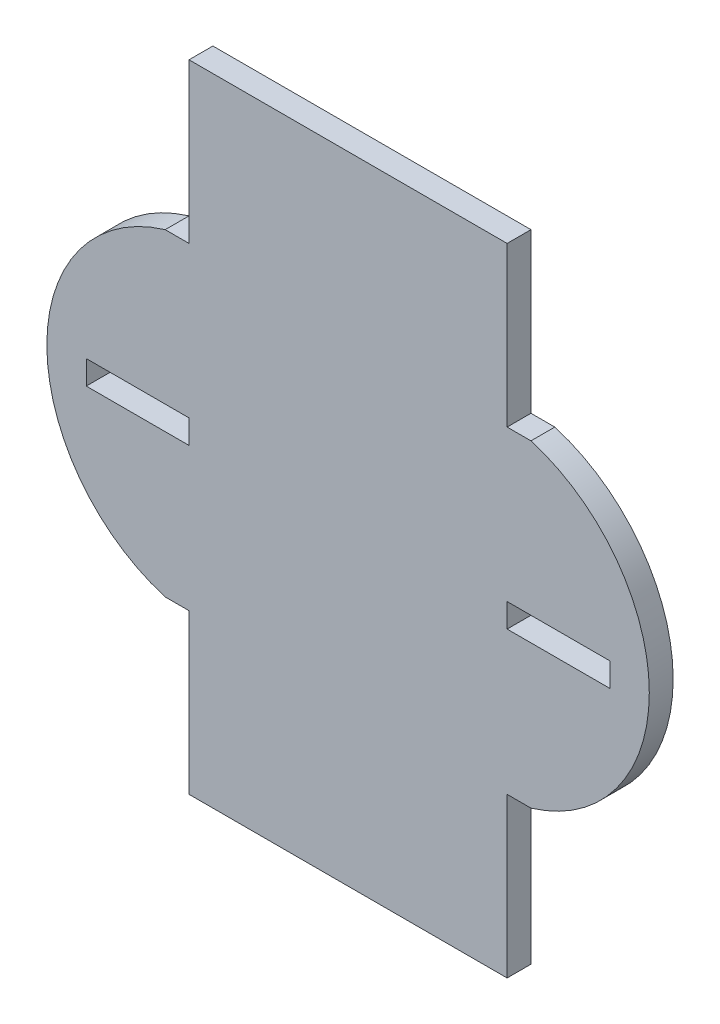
ISO-10303-21;
HEADER;
FILE_DESCRIPTION(('STEP AP214'),'2;1');
FILE_NAME('part.step','',(''),(''),'','','');
FILE_SCHEMA(('AUTOMOTIVE_DESIGN { 1 0 10303 214 1 1 1 1 }'));
ENDSEC;
DATA;
#1=APPLICATION_CONTEXT('core data for automotive mechanical design processes');
#2=APPLICATION_PROTOCOL_DEFINITION('international standard','automotive_design',2000,#1);
#3=PRODUCT_CONTEXT('',#1,'mechanical');
#4=PRODUCT('Part','Part','',(#3));
#5=PRODUCT_RELATED_PRODUCT_CATEGORY('part','',(#4));
#6=PRODUCT_DEFINITION_FORMATION('','',#4);
#7=PRODUCT_DEFINITION_CONTEXT('part definition',#1,'design');
#8=PRODUCT_DEFINITION('design','',#6,#7);
#9=PRODUCT_DEFINITION_SHAPE('','',#8);
#10=(LENGTH_UNIT() NAMED_UNIT(*) SI_UNIT(.MILLI.,.METRE.));
#11=(NAMED_UNIT(*) PLANE_ANGLE_UNIT() SI_UNIT($,.RADIAN.));
#12=(NAMED_UNIT(*) SI_UNIT($,.STERADIAN.) SOLID_ANGLE_UNIT());
#13=UNCERTAINTY_MEASURE_WITH_UNIT(LENGTH_MEASURE(1.E-05),#10,'distance_accuracy_value','');
#14=(GEOMETRIC_REPRESENTATION_CONTEXT(3) GLOBAL_UNCERTAINTY_ASSIGNED_CONTEXT((#13)) GLOBAL_UNIT_ASSIGNED_CONTEXT((#10,
#11,#12)) REPRESENTATION_CONTEXT('',''));
#15=CARTESIAN_POINT('',(0.,0.,0.));
#16=DIRECTION('',(0.,0.,1.));
#17=DIRECTION('',(1.,0.,0.));
#18=AXIS2_PLACEMENT_3D('',#15,#16,#17);
#19=CARTESIAN_POINT('',(-18.3157645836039,26.8156424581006,3.));
#20=DIRECTION('',(0.,0.,1.));
#21=DIRECTION('',(1.,0.,0.));
#22=AXIS2_PLACEMENT_3D('',#19,#20,#21);
#23=PLANE('',#22);
#24=DIRECTION('',(0.,-1.,0.));
#25=VECTOR('',#24,1.);
#26=CARTESIAN_POINT('',(-21.315764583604,66.8156424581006,3.));
#27=LINE('',#26,#25);
#28=CARTESIAN_POINT('',(-21.315764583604,66.8156424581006,3.));
#29=VERTEX_POINT('',#28);
#30=CARTESIAN_POINT('',(-21.315764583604,46.8156424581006,3.));
#31=VERTEX_POINT('',#30);
#32=EDGE_CURVE('E237',#29,#31,#27,.T.);
#33=ORIENTED_EDGE('',*,*,#32,.T.);
#34=DIRECTION('',(-1.,0.,0.));
#35=VECTOR('',#34,1.);
#36=CARTESIAN_POINT('',(-21.315764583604,46.8156424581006,3.));
#37=LINE('',#36,#35);
#38=CARTESIAN_POINT('',(-24.315764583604,46.8156424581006,3.));
#39=VERTEX_POINT('',#38);
#40=EDGE_CURVE('E240',#31,#39,#37,.T.);
#41=ORIENTED_EDGE('',*,*,#40,.T.);
#42=CARTESIAN_POINT('',(-18.3157645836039,26.8156424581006,3.));
#43=DIRECTION('',(0.,0.,1.));
#44=DIRECTION('',(1.,0.,0.));
#45=AXIS2_PLACEMENT_3D('',#42,#43,#44);
#46=CIRCLE('',#45,20.8806130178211);
#47=CARTESIAN_POINT('',(-24.315764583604,6.81564245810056,3.));
#48=VERTEX_POINT('',#47);
#49=EDGE_CURVE('E243',#39,#48,#46,.T.);
#50=ORIENTED_EDGE('',*,*,#49,.T.);
#51=DIRECTION('',(1.,0.,0.));
#52=VECTOR('',#51,1.);
#53=CARTESIAN_POINT('',(-24.315764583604,6.81564245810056,3.));
#54=LINE('',#53,#52);
#55=CARTESIAN_POINT('',(-21.315764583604,6.81564245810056,3.));
#56=VERTEX_POINT('',#55);
#57=EDGE_CURVE('E245',#48,#56,#54,.T.);
#58=ORIENTED_EDGE('',*,*,#57,.T.);
#59=DIRECTION('',(0.,-1.,0.));
#60=VECTOR('',#59,1.);
#61=CARTESIAN_POINT('',(-21.315764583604,6.81564245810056,3.));
#62=LINE('',#61,#60);
#63=CARTESIAN_POINT('',(-21.315764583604,-13.1843575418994,3.));
#64=VERTEX_POINT('',#63);
#65=EDGE_CURVE('E247',#56,#64,#62,.T.);
#66=ORIENTED_EDGE('',*,*,#65,.T.);
#67=DIRECTION('',(1.,0.,0.));
#68=VECTOR('',#67,1.);
#69=CARTESIAN_POINT('',(-21.315764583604,-13.1843575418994,3.));
#70=LINE('',#69,#68);
#71=CARTESIAN_POINT('',(18.684235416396,-13.1843575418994,3.));
#72=VERTEX_POINT('',#71);
#73=EDGE_CURVE('E249',#64,#72,#70,.T.);
#74=ORIENTED_EDGE('',*,*,#73,.T.);
#75=DIRECTION('',(0.,1.,0.));
#76=VECTOR('',#75,1.);
#77=CARTESIAN_POINT('',(18.684235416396,6.81564245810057,3.));
#78=LINE('',#77,#76);
#79=CARTESIAN_POINT('',(18.684235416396,6.81564245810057,3.));
#80=VERTEX_POINT('',#79);
#81=EDGE_CURVE('E251',#72,#80,#78,.T.);
#82=ORIENTED_EDGE('',*,*,#81,.T.);
#83=DIRECTION('',(1.,0.,0.));
#84=VECTOR('',#83,1.);
#85=CARTESIAN_POINT('',(21.684235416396,6.81564245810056,3.));
#86=LINE('',#85,#84);
#87=CARTESIAN_POINT('',(21.684235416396,6.81564245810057,3.));
#88=VERTEX_POINT('',#87);
#89=EDGE_CURVE('E253',#80,#88,#86,.T.);
#90=ORIENTED_EDGE('',*,*,#89,.T.);
#91=CARTESIAN_POINT('',(15.684235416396,26.8156424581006,3.));
#92=DIRECTION('',(0.,0.,1.));
#93=DIRECTION('',(-1.,0.,0.));
#94=AXIS2_PLACEMENT_3D('',#91,#92,#93);
#95=CIRCLE('',#94,20.8806130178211);
#96=CARTESIAN_POINT('',(21.684235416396,46.8156424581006,3.));
#97=VERTEX_POINT('',#96);
#98=EDGE_CURVE('E255',#88,#97,#95,.T.);
#99=ORIENTED_EDGE('',*,*,#98,.T.);
#100=DIRECTION('',(-1.,0.,0.));
#101=VECTOR('',#100,1.);
#102=CARTESIAN_POINT('',(18.684235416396,46.8156424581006,3.));
#103=LINE('',#102,#101);
#104=CARTESIAN_POINT('',(18.684235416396,46.8156424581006,3.));
#105=VERTEX_POINT('',#104);
#106=EDGE_CURVE('E257',#97,#105,#103,.T.);
#107=ORIENTED_EDGE('',*,*,#106,.T.);
#108=DIRECTION('',(0.,1.,0.));
#109=VECTOR('',#108,1.);
#110=CARTESIAN_POINT('',(18.684235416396,66.8156424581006,3.));
#111=LINE('',#110,#109);
#112=CARTESIAN_POINT('',(18.684235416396,66.8156424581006,3.));
#113=VERTEX_POINT('',#112);
#114=EDGE_CURVE('E259',#105,#113,#111,.T.);
#115=ORIENTED_EDGE('',*,*,#114,.T.);
#116=DIRECTION('',(-1.,0.,0.));
#117=VECTOR('',#116,1.);
#118=CARTESIAN_POINT('',(-21.315764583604,66.8156424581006,3.));
#119=LINE('',#118,#117);
#120=EDGE_CURVE('E261',#113,#29,#119,.T.);
#121=ORIENTED_EDGE('',*,*,#120,.T.);
#122=EDGE_LOOP('',(#33,#41,#50,#58,#66,#74,#82,#90,#99,#107,#115,#121));
#123=FACE_BOUND('',#122,.T.);
#124=DIRECTION('',(1.,0.,0.));
#125=VECTOR('',#124,1.);
#126=CARTESIAN_POINT('',(18.6842354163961,24.8156424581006,3.));
#127=LINE('',#126,#125);
#128=CARTESIAN_POINT('',(18.6842354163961,24.8156424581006,3.));
#129=VERTEX_POINT('',#128);
#130=CARTESIAN_POINT('',(31.6081280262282,24.8156424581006,3.));
#131=VERTEX_POINT('',#130);
#132=EDGE_CURVE('E208',#129,#131,#127,.T.);
#133=ORIENTED_EDGE('',*,*,#132,.F.);
#134=DIRECTION('',(0.,-1.,0.));
#135=VECTOR('',#134,1.);
#136=CARTESIAN_POINT('',(18.6842354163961,24.8156424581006,3.));
#137=LINE('',#136,#135);
#138=CARTESIAN_POINT('',(18.6842354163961,27.8156424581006,3.));
#139=VERTEX_POINT('',#138);
#140=EDGE_CURVE('E206',#139,#129,#137,.T.);
#141=ORIENTED_EDGE('',*,*,#140,.F.);
#142=DIRECTION('',(-1.,0.,0.));
#143=VECTOR('',#142,1.);
#144=CARTESIAN_POINT('',(18.6842354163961,27.8156424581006,3.));
#145=LINE('',#144,#143);
#146=CARTESIAN_POINT('',(31.6081280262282,27.8156424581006,3.));
#147=VERTEX_POINT('',#146);
#148=EDGE_CURVE('E214',#147,#139,#145,.T.);
#149=ORIENTED_EDGE('',*,*,#148,.F.);
#150=DIRECTION('',(0.,1.,0.));
#151=VECTOR('',#150,1.);
#152=CARTESIAN_POINT('',(31.6081280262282,24.8156424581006,3.));
#153=LINE('',#152,#151);
#154=EDGE_CURVE('E211',#131,#147,#153,.T.);
#155=ORIENTED_EDGE('',*,*,#154,.F.);
#156=EDGE_LOOP('',(#133,#141,#149,#155));
#157=FACE_BOUND('',#156,.T.);
#158=DIRECTION('',(0.,1.,0.));
#159=VECTOR('',#158,1.);
#160=CARTESIAN_POINT('',(-21.315764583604,24.8156424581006,3.));
#161=LINE('',#160,#159);
#162=CARTESIAN_POINT('',(-21.315764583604,24.8156424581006,3.));
#163=VERTEX_POINT('',#162);
#164=CARTESIAN_POINT('',(-21.315764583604,27.8156424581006,3.));
#165=VERTEX_POINT('',#164);
#166=EDGE_CURVE('E178',#163,#165,#161,.T.);
#167=ORIENTED_EDGE('',*,*,#166,.F.);
#168=DIRECTION('',(1.,0.,0.));
#169=VECTOR('',#168,1.);
#170=CARTESIAN_POINT('',(-21.315764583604,24.8156424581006,3.));
#171=LINE('',#170,#169);
#172=CARTESIAN_POINT('',(-34.2396571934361,24.8156424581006,3.));
#173=VERTEX_POINT('',#172);
#174=EDGE_CURVE('E170',#173,#163,#171,.T.);
#175=ORIENTED_EDGE('',*,*,#174,.F.);
#176=DIRECTION('',(0.,-1.,0.));
#177=VECTOR('',#176,1.);
#178=CARTESIAN_POINT('',(-34.2396571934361,24.8156424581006,3.));
#179=LINE('',#178,#177);
#180=CARTESIAN_POINT('',(-34.2396571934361,27.8156424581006,3.));
#181=VERTEX_POINT('',#180);
#182=EDGE_CURVE('E192',#181,#173,#179,.T.);
#183=ORIENTED_EDGE('',*,*,#182,.F.);
#184=DIRECTION('',(-1.,0.,0.));
#185=VECTOR('',#184,1.);
#186=CARTESIAN_POINT('',(-21.315764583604,27.8156424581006,3.));
#187=LINE('',#186,#185);
#188=EDGE_CURVE('E190',#165,#181,#187,.T.);
#189=ORIENTED_EDGE('',*,*,#188,.F.);
#190=EDGE_LOOP('',(#167,#175,#183,#189));
#191=FACE_BOUND('',#190,.T.);
#192=ADVANCED_FACE('F33',(#123,#157,#191),#23,.T.);
#193=CARTESIAN_POINT('',(-18.3157645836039,26.8156424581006,0.));
#194=DIRECTION('',(0.,0.,1.));
#195=DIRECTION('',(1.,0.,0.));
#196=AXIS2_PLACEMENT_3D('',#193,#194,#195);
#197=PLANE('',#196);
#198=DIRECTION('',(0.,-1.,0.));
#199=VECTOR('',#198,1.);
#200=CARTESIAN_POINT('',(18.6842354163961,24.8156424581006,0.));
#201=LINE('',#200,#199);
#202=CARTESIAN_POINT('',(18.6842354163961,27.8156424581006,0.));
#203=VERTEX_POINT('',#202);
#204=CARTESIAN_POINT('',(18.6842354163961,24.8156424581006,0.));
#205=VERTEX_POINT('',#204);
#206=EDGE_CURVE('E186',#203,#205,#201,.T.);
#207=ORIENTED_EDGE('',*,*,#206,.T.);
#208=DIRECTION('',(1.,0.,0.));
#209=VECTOR('',#208,1.);
#210=CARTESIAN_POINT('',(18.6842354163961,24.8156424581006,0.));
#211=LINE('',#210,#209);
#212=CARTESIAN_POINT('',(31.6081280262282,24.8156424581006,0.));
#213=VERTEX_POINT('',#212);
#214=EDGE_CURVE('E219',#205,#213,#211,.T.);
#215=ORIENTED_EDGE('',*,*,#214,.T.);
#216=DIRECTION('',(0.,1.,0.));
#217=VECTOR('',#216,1.);
#218=CARTESIAN_POINT('',(31.6081280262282,24.8156424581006,0.));
#219=LINE('',#218,#217);
#220=CARTESIAN_POINT('',(31.6081280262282,27.8156424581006,0.));
#221=VERTEX_POINT('',#220);
#222=EDGE_CURVE('E222',#213,#221,#219,.T.);
#223=ORIENTED_EDGE('',*,*,#222,.T.);
#224=DIRECTION('',(-1.,0.,0.));
#225=VECTOR('',#224,1.);
#226=CARTESIAN_POINT('',(18.6842354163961,27.8156424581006,0.));
#227=LINE('',#226,#225);
#228=EDGE_CURVE('E209',#221,#203,#227,.T.);
#229=ORIENTED_EDGE('',*,*,#228,.T.);
#230=EDGE_LOOP('',(#207,#215,#223,#229));
#231=FACE_BOUND('',#230,.T.);
#232=DIRECTION('',(0.,-1.,0.));
#233=VECTOR('',#232,1.);
#234=CARTESIAN_POINT('',(-21.315764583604,66.8156424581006,0.));
#235=LINE('',#234,#233);
#236=CARTESIAN_POINT('',(-21.315764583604,66.8156424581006,0.));
#237=VERTEX_POINT('',#236);
#238=CARTESIAN_POINT('',(-21.315764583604,46.8156424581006,0.));
#239=VERTEX_POINT('',#238);
#240=EDGE_CURVE('E236',#237,#239,#235,.T.);
#241=ORIENTED_EDGE('',*,*,#240,.F.);
#242=DIRECTION('',(-1.,0.,0.));
#243=VECTOR('',#242,1.);
#244=CARTESIAN_POINT('',(-21.315764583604,66.8156424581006,0.));
#245=LINE('',#244,#243);
#246=CARTESIAN_POINT('',(18.684235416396,66.8156424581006,0.));
#247=VERTEX_POINT('',#246);
#248=EDGE_CURVE('E241',#247,#237,#245,.T.);
#249=ORIENTED_EDGE('',*,*,#248,.F.);
#250=DIRECTION('',(0.,1.,0.));
#251=VECTOR('',#250,1.);
#252=CARTESIAN_POINT('',(18.684235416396,66.8156424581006,0.));
#253=LINE('',#252,#251);
#254=CARTESIAN_POINT('',(18.684235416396,46.8156424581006,0.));
#255=VERTEX_POINT('',#254);
#256=EDGE_CURVE('E284',#255,#247,#253,.T.);
#257=ORIENTED_EDGE('',*,*,#256,.F.);
#258=DIRECTION('',(-1.,0.,0.));
#259=VECTOR('',#258,1.);
#260=CARTESIAN_POINT('',(18.684235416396,46.8156424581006,0.));
#261=LINE('',#260,#259);
#262=CARTESIAN_POINT('',(21.684235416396,46.8156424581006,0.));
#263=VERTEX_POINT('',#262);
#264=EDGE_CURVE('E282',#263,#255,#261,.T.);
#265=ORIENTED_EDGE('',*,*,#264,.F.);
#266=CARTESIAN_POINT('',(15.684235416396,26.8156424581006,0.));
#267=DIRECTION('',(0.,0.,1.));
#268=DIRECTION('',(-1.,0.,0.));
#269=AXIS2_PLACEMENT_3D('',#266,#267,#268);
#270=CIRCLE('',#269,20.8806130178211);
#271=CARTESIAN_POINT('',(21.684235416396,6.81564245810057,0.));
#272=VERTEX_POINT('',#271);
#273=EDGE_CURVE('E280',#272,#263,#270,.T.);
#274=ORIENTED_EDGE('',*,*,#273,.F.);
#275=DIRECTION('',(1.,0.,0.));
#276=VECTOR('',#275,1.);
#277=CARTESIAN_POINT('',(21.684235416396,6.81564245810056,0.));
#278=LINE('',#277,#276);
#279=CARTESIAN_POINT('',(18.684235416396,6.81564245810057,0.));
#280=VERTEX_POINT('',#279);
#281=EDGE_CURVE('E278',#280,#272,#278,.T.);
#282=ORIENTED_EDGE('',*,*,#281,.F.);
#283=DIRECTION('',(0.,1.,0.));
#284=VECTOR('',#283,1.);
#285=CARTESIAN_POINT('',(18.684235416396,6.81564245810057,0.));
#286=LINE('',#285,#284);
#287=CARTESIAN_POINT('',(18.684235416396,-13.1843575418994,0.));
#288=VERTEX_POINT('',#287);
#289=EDGE_CURVE('E276',#288,#280,#286,.T.);
#290=ORIENTED_EDGE('',*,*,#289,.F.);
#291=DIRECTION('',(1.,0.,0.));
#292=VECTOR('',#291,1.);
#293=CARTESIAN_POINT('',(-21.315764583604,-13.1843575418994,0.));
#294=LINE('',#293,#292);
#295=CARTESIAN_POINT('',(-21.315764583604,-13.1843575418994,0.));
#296=VERTEX_POINT('',#295);
#297=EDGE_CURVE('E274',#296,#288,#294,.T.);
#298=ORIENTED_EDGE('',*,*,#297,.F.);
#299=DIRECTION('',(0.,-1.,0.));
#300=VECTOR('',#299,1.);
#301=CARTESIAN_POINT('',(-21.315764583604,6.81564245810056,0.));
#302=LINE('',#301,#300);
#303=CARTESIAN_POINT('',(-21.315764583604,6.81564245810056,0.));
#304=VERTEX_POINT('',#303);
#305=EDGE_CURVE('E272',#304,#296,#302,.T.);
#306=ORIENTED_EDGE('',*,*,#305,.F.);
#307=DIRECTION('',(1.,0.,0.));
#308=VECTOR('',#307,1.);
#309=CARTESIAN_POINT('',(-24.315764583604,6.81564245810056,0.));
#310=LINE('',#309,#308);
#311=CARTESIAN_POINT('',(-24.315764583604,6.81564245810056,0.));
#312=VERTEX_POINT('',#311);
#313=EDGE_CURVE('E270',#312,#304,#310,.T.);
#314=ORIENTED_EDGE('',*,*,#313,.F.);
#315=CARTESIAN_POINT('',(-18.3157645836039,26.8156424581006,0.));
#316=DIRECTION('',(0.,0.,1.));
#317=DIRECTION('',(1.,0.,0.));
#318=AXIS2_PLACEMENT_3D('',#315,#316,#317);
#319=CIRCLE('',#318,20.8806130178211);
#320=CARTESIAN_POINT('',(-24.315764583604,46.8156424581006,0.));
#321=VERTEX_POINT('',#320);
#322=EDGE_CURVE('E268',#321,#312,#319,.T.);
#323=ORIENTED_EDGE('',*,*,#322,.F.);
#324=DIRECTION('',(-1.,0.,0.));
#325=VECTOR('',#324,1.);
#326=CARTESIAN_POINT('',(-21.315764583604,46.8156424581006,0.));
#327=LINE('',#326,#325);
#328=EDGE_CURVE('E266',#239,#321,#327,.T.);
#329=ORIENTED_EDGE('',*,*,#328,.F.);
#330=EDGE_LOOP('',(#241,#249,#257,#265,#274,#282,#290,#298,#306,#314,#323,#329));
#331=FACE_BOUND('',#330,.T.);
#332=DIRECTION('',(1.,0.,0.));
#333=VECTOR('',#332,1.);
#334=CARTESIAN_POINT('',(-21.315764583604,24.8156424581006,0.));
#335=LINE('',#334,#333);
#336=CARTESIAN_POINT('',(-34.2396571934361,24.8156424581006,0.));
#337=VERTEX_POINT('',#336);
#338=CARTESIAN_POINT('',(-21.315764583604,24.8156424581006,0.));
#339=VERTEX_POINT('',#338);
#340=EDGE_CURVE('E56',#337,#339,#335,.T.);
#341=ORIENTED_EDGE('',*,*,#340,.T.);
#342=DIRECTION('',(0.,1.,0.));
#343=VECTOR('',#342,1.);
#344=CARTESIAN_POINT('',(-21.315764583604,24.8156424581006,0.));
#345=LINE('',#344,#343);
#346=CARTESIAN_POINT('',(-21.315764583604,27.8156424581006,0.));
#347=VERTEX_POINT('',#346);
#348=EDGE_CURVE('E185',#339,#347,#345,.T.);
#349=ORIENTED_EDGE('',*,*,#348,.T.);
#350=DIRECTION('',(-1.,0.,0.));
#351=VECTOR('',#350,1.);
#352=CARTESIAN_POINT('',(-21.315764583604,27.8156424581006,0.));
#353=LINE('',#352,#351);
#354=CARTESIAN_POINT('',(-34.2396571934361,27.8156424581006,0.));
#355=VERTEX_POINT('',#354);
#356=EDGE_CURVE('E198',#347,#355,#353,.T.);
#357=ORIENTED_EDGE('',*,*,#356,.T.);
#358=DIRECTION('',(0.,-1.,0.));
#359=VECTOR('',#358,1.);
#360=CARTESIAN_POINT('',(-34.2396571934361,24.8156424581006,0.));
#361=LINE('',#360,#359);
#362=EDGE_CURVE('E179',#355,#337,#361,.T.);
#363=ORIENTED_EDGE('',*,*,#362,.T.);
#364=EDGE_LOOP('',(#341,#349,#357,#363));
#365=FACE_BOUND('',#364,.T.);
#366=ADVANCED_FACE('F326',(#231,#331,#365),#197,.F.);
#367=CARTESIAN_POINT('',(-21.315764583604,66.8156424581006,3.));
#368=DIRECTION('',(1.,0.,0.));
#369=DIRECTION('',(0.,1.,0.));
#370=AXIS2_PLACEMENT_3D('',#367,#368,#369);
#371=PLANE('',#370);
#372=ORIENTED_EDGE('',*,*,#240,.T.);
#373=DIRECTION('',(0.,0.,-1.));
#374=VECTOR('',#373,1.);
#375=CARTESIAN_POINT('',(-21.315764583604,46.8156424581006,3.));
#376=LINE('',#375,#374);
#377=EDGE_CURVE('E11',#31,#239,#376,.T.);
#378=ORIENTED_EDGE('',*,*,#377,.F.);
#379=ORIENTED_EDGE('',*,*,#32,.F.);
#380=DIRECTION('',(0.,0.,-1.));
#381=VECTOR('',#380,1.);
#382=CARTESIAN_POINT('',(-21.315764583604,66.8156424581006,3.));
#383=LINE('',#382,#381);
#384=EDGE_CURVE('E263',#29,#237,#383,.T.);
#385=ORIENTED_EDGE('',*,*,#384,.T.);
#386=EDGE_LOOP('',(#372,#378,#379,#385));
#387=FACE_BOUND('',#386,.T.);
#388=ADVANCED_FACE('F35',(#387),#371,.F.);
#389=CARTESIAN_POINT('',(-21.315764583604,46.8156424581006,3.));
#390=DIRECTION('',(0.,-1.,0.));
#391=DIRECTION('',(0.,0.,-1.));
#392=AXIS2_PLACEMENT_3D('',#389,#390,#391);
#393=PLANE('',#392);
#394=ORIENTED_EDGE('',*,*,#328,.T.);
#395=DIRECTION('',(0.,0.,-1.));
#396=VECTOR('',#395,1.);
#397=CARTESIAN_POINT('',(-24.315764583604,46.8156424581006,3.));
#398=LINE('',#397,#396);
#399=EDGE_CURVE('E41',#39,#321,#398,.T.);
#400=ORIENTED_EDGE('',*,*,#399,.F.);
#401=ORIENTED_EDGE('',*,*,#40,.F.);
#402=ORIENTED_EDGE('',*,*,#377,.T.);
#403=EDGE_LOOP('',(#394,#400,#401,#402));
#404=FACE_BOUND('',#403,.T.);
#405=ADVANCED_FACE('F344',(#404),#393,.F.);
#406=CARTESIAN_POINT('',(-18.3157645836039,26.8156424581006,3.));
#407=DIRECTION('',(0.,0.,-1.));
#408=DIRECTION('',(-1.,0.,0.));
#409=AXIS2_PLACEMENT_3D('',#406,#407,#408);
#410=CYLINDRICAL_SURFACE('',#409,20.8806130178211);
#411=ORIENTED_EDGE('',*,*,#322,.T.);
#412=DIRECTION('',(0.,0.,-1.));
#413=VECTOR('',#412,1.);
#414=CARTESIAN_POINT('',(-24.315764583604,6.81564245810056,3.));
#415=LINE('',#414,#413);
#416=EDGE_CURVE('E313',#48,#312,#415,.T.);
#417=ORIENTED_EDGE('',*,*,#416,.F.);
#418=ORIENTED_EDGE('',*,*,#49,.F.);
#419=ORIENTED_EDGE('',*,*,#399,.T.);
#420=EDGE_LOOP('',(#411,#417,#418,#419));
#421=FACE_BOUND('',#420,.T.);
#422=ADVANCED_FACE('F320',(#421),#410,.T.);
#423=CARTESIAN_POINT('',(-24.315764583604,6.81564245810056,3.));
#424=DIRECTION('',(0.,1.,0.));
#425=DIRECTION('',(0.,0.,1.));
#426=AXIS2_PLACEMENT_3D('',#423,#424,#425);
#427=PLANE('',#426);
#428=ORIENTED_EDGE('',*,*,#313,.T.);
#429=DIRECTION('',(0.,0.,-1.));
#430=VECTOR('',#429,1.);
#431=CARTESIAN_POINT('',(-21.315764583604,6.81564245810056,3.));
#432=LINE('',#431,#430);
#433=EDGE_CURVE('E310',#56,#304,#432,.T.);
#434=ORIENTED_EDGE('',*,*,#433,.F.);
#435=ORIENTED_EDGE('',*,*,#57,.F.);
#436=ORIENTED_EDGE('',*,*,#416,.T.);
#437=EDGE_LOOP('',(#428,#434,#435,#436));
#438=FACE_BOUND('',#437,.T.);
#439=ADVANCED_FACE('F332',(#438),#427,.F.);
#440=CARTESIAN_POINT('',(-21.315764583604,6.81564245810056,3.));
#441=DIRECTION('',(1.,0.,0.));
#442=DIRECTION('',(0.,0.,-1.));
#443=AXIS2_PLACEMENT_3D('',#440,#441,#442);
#444=PLANE('',#443);
#445=ORIENTED_EDGE('',*,*,#305,.T.);
#446=DIRECTION('',(0.,0.,-1.));
#447=VECTOR('',#446,1.);
#448=CARTESIAN_POINT('',(-21.315764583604,-13.1843575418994,3.));
#449=LINE('',#448,#447);
#450=EDGE_CURVE('E307',#64,#296,#449,.T.);
#451=ORIENTED_EDGE('',*,*,#450,.F.);
#452=ORIENTED_EDGE('',*,*,#65,.F.);
#453=ORIENTED_EDGE('',*,*,#433,.T.);
#454=EDGE_LOOP('',(#445,#451,#452,#453));
#455=FACE_BOUND('',#454,.T.);
#456=ADVANCED_FACE('F336',(#455),#444,.F.);
#457=CARTESIAN_POINT('',(-21.315764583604,-13.1843575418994,3.));
#458=DIRECTION('',(0.,1.,0.));
#459=DIRECTION('',(0.,0.,1.));
#460=AXIS2_PLACEMENT_3D('',#457,#458,#459);
#461=PLANE('',#460);
#462=ORIENTED_EDGE('',*,*,#297,.T.);
#463=DIRECTION('',(0.,0.,-1.));
#464=VECTOR('',#463,1.);
#465=CARTESIAN_POINT('',(18.684235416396,-13.1843575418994,3.));
#466=LINE('',#465,#464);
#467=EDGE_CURVE('E304',#72,#288,#466,.T.);
#468=ORIENTED_EDGE('',*,*,#467,.F.);
#469=ORIENTED_EDGE('',*,*,#73,.F.);
#470=ORIENTED_EDGE('',*,*,#450,.T.);
#471=EDGE_LOOP('',(#462,#468,#469,#470));
#472=FACE_BOUND('',#471,.T.);
#473=ADVANCED_FACE('F377',(#472),#461,.F.);
#474=CARTESIAN_POINT('',(18.684235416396,6.81564245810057,3.));
#475=DIRECTION('',(-1.,0.,0.));
#476=DIRECTION('',(0.,-1.,0.));
#477=AXIS2_PLACEMENT_3D('',#474,#475,#476);
#478=PLANE('',#477);
#479=ORIENTED_EDGE('',*,*,#289,.T.);
#480=DIRECTION('',(0.,0.,-1.));
#481=VECTOR('',#480,1.);
#482=CARTESIAN_POINT('',(18.684235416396,6.81564245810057,3.));
#483=LINE('',#482,#481);
#484=EDGE_CURVE('E301',#80,#280,#483,.T.);
#485=ORIENTED_EDGE('',*,*,#484,.F.);
#486=ORIENTED_EDGE('',*,*,#81,.F.);
#487=ORIENTED_EDGE('',*,*,#467,.T.);
#488=EDGE_LOOP('',(#479,#485,#486,#487));
#489=FACE_BOUND('',#488,.T.);
#490=ADVANCED_FACE('F375',(#489),#478,.F.);
#491=CARTESIAN_POINT('',(21.684235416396,6.81564245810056,3.));
#492=DIRECTION('',(0.,1.,0.));
#493=DIRECTION('',(-1.,0.,0.));
#494=AXIS2_PLACEMENT_3D('',#491,#492,#493);
#495=PLANE('',#494);
#496=ORIENTED_EDGE('',*,*,#281,.T.);
#497=DIRECTION('',(0.,0.,-1.));
#498=VECTOR('',#497,1.);
#499=CARTESIAN_POINT('',(21.684235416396,6.81564245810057,3.));
#500=LINE('',#499,#498);
#501=EDGE_CURVE('E298',#88,#272,#500,.T.);
#502=ORIENTED_EDGE('',*,*,#501,.F.);
#503=ORIENTED_EDGE('',*,*,#89,.F.);
#504=ORIENTED_EDGE('',*,*,#484,.T.);
#505=EDGE_LOOP('',(#496,#502,#503,#504));
#506=FACE_BOUND('',#505,.T.);
#507=ADVANCED_FACE('F371',(#506),#495,.F.);
#508=CARTESIAN_POINT('',(15.684235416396,26.8156424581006,3.));
#509=DIRECTION('',(0.,0.,-1.));
#510=DIRECTION('',(-1.,0.,0.));
#511=AXIS2_PLACEMENT_3D('',#508,#509,#510);
#512=CYLINDRICAL_SURFACE('',#511,20.8806130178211);
#513=ORIENTED_EDGE('',*,*,#273,.T.);
#514=DIRECTION('',(0.,0.,-1.));
#515=VECTOR('',#514,1.);
#516=CARTESIAN_POINT('',(21.684235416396,46.8156424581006,3.));
#517=LINE('',#516,#515);
#518=EDGE_CURVE('E295',#97,#263,#517,.T.);
#519=ORIENTED_EDGE('',*,*,#518,.F.);
#520=ORIENTED_EDGE('',*,*,#98,.F.);
#521=ORIENTED_EDGE('',*,*,#501,.T.);
#522=EDGE_LOOP('',(#513,#519,#520,#521));
#523=FACE_BOUND('',#522,.T.);
#524=ADVANCED_FACE('F366',(#523),#512,.T.);
#525=CARTESIAN_POINT('',(18.684235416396,46.8156424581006,3.));
#526=DIRECTION('',(0.,-1.,0.));
#527=DIRECTION('',(0.,0.,-1.));
#528=AXIS2_PLACEMENT_3D('',#525,#526,#527);
#529=PLANE('',#528);
#530=ORIENTED_EDGE('',*,*,#264,.T.);
#531=DIRECTION('',(0.,0.,-1.));
#532=VECTOR('',#531,1.);
#533=CARTESIAN_POINT('',(18.684235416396,46.8156424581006,3.));
#534=LINE('',#533,#532);
#535=EDGE_CURVE('E292',#105,#255,#534,.T.);
#536=ORIENTED_EDGE('',*,*,#535,.F.);
#537=ORIENTED_EDGE('',*,*,#106,.F.);
#538=ORIENTED_EDGE('',*,*,#518,.T.);
#539=EDGE_LOOP('',(#530,#536,#537,#538));
#540=FACE_BOUND('',#539,.T.);
#541=ADVANCED_FACE('F360',(#540),#529,.F.);
#542=CARTESIAN_POINT('',(18.684235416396,66.8156424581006,3.));
#543=DIRECTION('',(-1.,0.,0.));
#544=DIRECTION('',(0.,0.,1.));
#545=AXIS2_PLACEMENT_3D('',#542,#543,#544);
#546=PLANE('',#545);
#547=ORIENTED_EDGE('',*,*,#256,.T.);
#548=DIRECTION('',(0.,0.,-1.));
#549=VECTOR('',#548,1.);
#550=CARTESIAN_POINT('',(18.684235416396,66.8156424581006,3.));
#551=LINE('',#550,#549);
#552=EDGE_CURVE('E289',#113,#247,#551,.T.);
#553=ORIENTED_EDGE('',*,*,#552,.F.);
#554=ORIENTED_EDGE('',*,*,#114,.F.);
#555=ORIENTED_EDGE('',*,*,#535,.T.);
#556=EDGE_LOOP('',(#547,#553,#554,#555));
#557=FACE_BOUND('',#556,.T.);
#558=ADVANCED_FACE('F356',(#557),#546,.F.);
#559=CARTESIAN_POINT('',(-21.315764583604,66.8156424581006,3.));
#560=DIRECTION('',(0.,-1.,0.));
#561=DIRECTION('',(0.,0.,-1.));
#562=AXIS2_PLACEMENT_3D('',#559,#560,#561);
#563=PLANE('',#562);
#564=ORIENTED_EDGE('',*,*,#248,.T.);
#565=ORIENTED_EDGE('',*,*,#384,.F.);
#566=ORIENTED_EDGE('',*,*,#120,.F.);
#567=ORIENTED_EDGE('',*,*,#552,.T.);
#568=EDGE_LOOP('',(#564,#565,#566,#567));
#569=FACE_BOUND('',#568,.T.);
#570=ADVANCED_FACE('F351',(#569),#563,.F.);
#571=CARTESIAN_POINT('',(18.6842354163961,24.8156424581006,3.));
#572=DIRECTION('',(1.,0.,0.));
#573=DIRECTION('',(0.,0.,-1.));
#574=AXIS2_PLACEMENT_3D('',#571,#572,#573);
#575=PLANE('',#574);
#576=ORIENTED_EDGE('',*,*,#206,.F.);
#577=DIRECTION('',(0.,0.,-1.));
#578=VECTOR('',#577,1.);
#579=CARTESIAN_POINT('',(18.6842354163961,27.8156424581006,3.));
#580=LINE('',#579,#578);
#581=EDGE_CURVE('E216',#139,#203,#580,.T.);
#582=ORIENTED_EDGE('',*,*,#581,.F.);
#583=ORIENTED_EDGE('',*,*,#140,.T.);
#584=DIRECTION('',(0.,0.,-1.));
#585=VECTOR('',#584,1.);
#586=CARTESIAN_POINT('',(18.6842354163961,24.8156424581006,3.));
#587=LINE('',#586,#585);
#588=EDGE_CURVE('E233',#129,#205,#587,.T.);
#589=ORIENTED_EDGE('',*,*,#588,.T.);
#590=EDGE_LOOP('',(#576,#582,#583,#589));
#591=FACE_BOUND('',#590,.T.);
#592=ADVANCED_FACE('F394',(#591),#575,.T.);
#593=CARTESIAN_POINT('',(18.6842354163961,24.8156424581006,3.));
#594=DIRECTION('',(0.,1.,0.));
#595=DIRECTION('',(0.,0.,1.));
#596=AXIS2_PLACEMENT_3D('',#593,#594,#595);
#597=PLANE('',#596);
#598=ORIENTED_EDGE('',*,*,#214,.F.);
#599=ORIENTED_EDGE('',*,*,#588,.F.);
#600=ORIENTED_EDGE('',*,*,#132,.T.);
#601=DIRECTION('',(0.,0.,-1.));
#602=VECTOR('',#601,1.);
#603=CARTESIAN_POINT('',(31.6081280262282,24.8156424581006,3.));
#604=LINE('',#603,#602);
#605=EDGE_CURVE('E231',#131,#213,#604,.T.);
#606=ORIENTED_EDGE('',*,*,#605,.T.);
#607=EDGE_LOOP('',(#598,#599,#600,#606));
#608=FACE_BOUND('',#607,.T.);
#609=ADVANCED_FACE('F432',(#608),#597,.T.);
#610=CARTESIAN_POINT('',(31.6081280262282,24.8156424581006,3.));
#611=DIRECTION('',(-1.,0.,0.));
#612=DIRECTION('',(0.,0.,1.));
#613=AXIS2_PLACEMENT_3D('',#610,#611,#612);
#614=PLANE('',#613);
#615=ORIENTED_EDGE('',*,*,#222,.F.);
#616=ORIENTED_EDGE('',*,*,#605,.F.);
#617=ORIENTED_EDGE('',*,*,#154,.T.);
#618=DIRECTION('',(0.,0.,-1.));
#619=VECTOR('',#618,1.);
#620=CARTESIAN_POINT('',(31.6081280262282,27.8156424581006,3.));
#621=LINE('',#620,#619);
#622=EDGE_CURVE('E229',#147,#221,#621,.T.);
#623=ORIENTED_EDGE('',*,*,#622,.T.);
#624=EDGE_LOOP('',(#615,#616,#617,#623));
#625=FACE_BOUND('',#624,.T.);
#626=ADVANCED_FACE('F439',(#625),#614,.T.);
#627=CARTESIAN_POINT('',(18.6842354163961,27.8156424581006,3.));
#628=DIRECTION('',(0.,-1.,0.));
#629=DIRECTION('',(0.,0.,-1.));
#630=AXIS2_PLACEMENT_3D('',#627,#628,#629);
#631=PLANE('',#630);
#632=ORIENTED_EDGE('',*,*,#228,.F.);
#633=ORIENTED_EDGE('',*,*,#622,.F.);
#634=ORIENTED_EDGE('',*,*,#148,.T.);
#635=ORIENTED_EDGE('',*,*,#581,.T.);
#636=EDGE_LOOP('',(#632,#633,#634,#635));
#637=FACE_BOUND('',#636,.T.);
#638=ADVANCED_FACE('F446',(#637),#631,.T.);
#639=CARTESIAN_POINT('',(-21.315764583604,24.8156424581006,3.));
#640=DIRECTION('',(0.,1.,0.));
#641=DIRECTION('',(0.,0.,1.));
#642=AXIS2_PLACEMENT_3D('',#639,#640,#641);
#643=PLANE('',#642);
#644=ORIENTED_EDGE('',*,*,#340,.F.);
#645=DIRECTION('',(0.,0.,-1.));
#646=VECTOR('',#645,1.);
#647=CARTESIAN_POINT('',(-34.2396571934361,24.8156424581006,3.));
#648=LINE('',#647,#646);
#649=EDGE_CURVE('E174',#173,#337,#648,.T.);
#650=ORIENTED_EDGE('',*,*,#649,.F.);
#651=ORIENTED_EDGE('',*,*,#174,.T.);
#652=DIRECTION('',(0.,0.,-1.));
#653=VECTOR('',#652,1.);
#654=CARTESIAN_POINT('',(-21.315764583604,24.8156424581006,3.));
#655=LINE('',#654,#653);
#656=EDGE_CURVE('E173',#163,#339,#655,.T.);
#657=ORIENTED_EDGE('',*,*,#656,.T.);
#658=EDGE_LOOP('',(#644,#650,#651,#657));
#659=FACE_BOUND('',#658,.T.);
#660=ADVANCED_FACE('F172',(#659),#643,.T.);
#661=CARTESIAN_POINT('',(-21.315764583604,24.8156424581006,3.));
#662=DIRECTION('',(-1.,0.,0.));
#663=DIRECTION('',(0.,0.,1.));
#664=AXIS2_PLACEMENT_3D('',#661,#662,#663);
#665=PLANE('',#664);
#666=ORIENTED_EDGE('',*,*,#348,.F.);
#667=ORIENTED_EDGE('',*,*,#656,.F.);
#668=ORIENTED_EDGE('',*,*,#166,.T.);
#669=DIRECTION('',(0.,0.,-1.));
#670=VECTOR('',#669,1.);
#671=CARTESIAN_POINT('',(-21.315764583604,27.8156424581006,3.));
#672=LINE('',#671,#670);
#673=EDGE_CURVE('E187',#165,#347,#672,.T.);
#674=ORIENTED_EDGE('',*,*,#673,.T.);
#675=EDGE_LOOP('',(#666,#667,#668,#674));
#676=FACE_BOUND('',#675,.T.);
#677=ADVANCED_FACE('F182',(#676),#665,.T.);
#678=CARTESIAN_POINT('',(-21.315764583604,27.8156424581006,3.));
#679=DIRECTION('',(0.,-1.,0.));
#680=DIRECTION('',(0.,0.,-1.));
#681=AXIS2_PLACEMENT_3D('',#678,#679,#680);
#682=PLANE('',#681);
#683=ORIENTED_EDGE('',*,*,#356,.F.);
#684=ORIENTED_EDGE('',*,*,#673,.F.);
#685=ORIENTED_EDGE('',*,*,#188,.T.);
#686=DIRECTION('',(0.,0.,-1.));
#687=VECTOR('',#686,1.);
#688=CARTESIAN_POINT('',(-34.2396571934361,27.8156424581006,3.));
#689=LINE('',#688,#687);
#690=EDGE_CURVE('E48',#181,#355,#689,.T.);
#691=ORIENTED_EDGE('',*,*,#690,.T.);
#692=EDGE_LOOP('',(#683,#684,#685,#691));
#693=FACE_BOUND('',#692,.T.);
#694=ADVANCED_FACE('F467',(#693),#682,.T.);
#695=CARTESIAN_POINT('',(-34.2396571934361,24.8156424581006,3.));
#696=DIRECTION('',(1.,0.,0.));
#697=DIRECTION('',(0.,0.,-1.));
#698=AXIS2_PLACEMENT_3D('',#695,#696,#697);
#699=PLANE('',#698);
#700=ORIENTED_EDGE('',*,*,#362,.F.);
#701=ORIENTED_EDGE('',*,*,#690,.F.);
#702=ORIENTED_EDGE('',*,*,#182,.T.);
#703=ORIENTED_EDGE('',*,*,#649,.T.);
#704=EDGE_LOOP('',(#700,#701,#702,#703));
#705=FACE_BOUND('',#704,.T.);
#706=ADVANCED_FACE('F474',(#705),#699,.T.);
#707=CLOSED_SHELL('',(#192,#366,#388,#405,#422,#439,#456,#473,#490,#507,#524,#541,#558,#570,
#592,#609,#626,#638,#660,#677,#694,#706));
#708=MANIFOLD_SOLID_BREP('B2',#707);
#709=ADVANCED_BREP_SHAPE_REPRESENTATION('',(#18,#708),#14);
#710=SHAPE_DEFINITION_REPRESENTATION(#9,#709);
ENDSEC;
END-ISO-10303-21;
